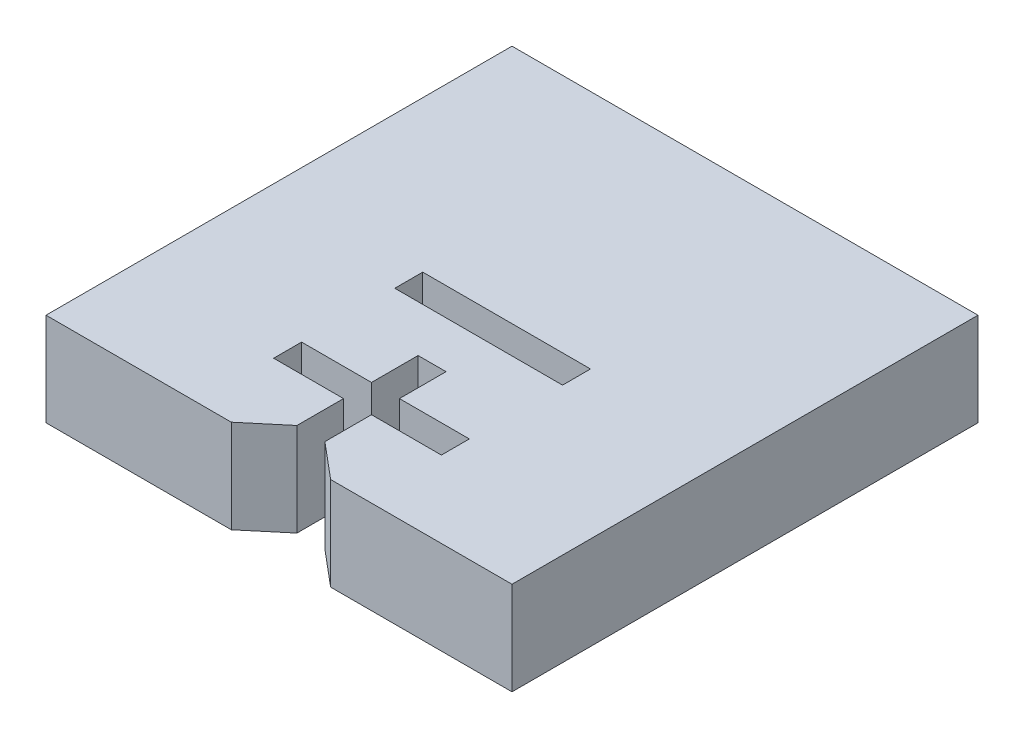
from build123d import *

# Parameters (mm, degrees)
SKETCH1_W           = 18
SKETCH1_H           = 3
BOSS_EXTRUDE1_DEPTH = 10


with BuildPart() as part:
    # Sketch1 → Boss-Extrude1 (new body)
    with BuildSketch(Plane(origin=(0, 0, 0), x_dir=(1, 0, 0), z_dir=(0, 1, 0))):
        Polygon((-30.998896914, 54.583699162), (-11.119378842, 54.583699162), (-7.289156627, 57.797637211), (-7.289156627, 62.797637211), (-14.789156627, 62.797637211), (-14.789156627, 65.797637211), (-7.289156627, 65.797637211), (-7.289156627, 70.797637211), (-4.289156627, 70.797637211), (-4.289156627, 65.797637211), (3.210843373, 65.797637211), (3.210843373, 62.797637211), (-4.289156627, 62.797637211), (-4.289156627, 57.797637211), (-0.458934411, 54.583699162), (19.001103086, 54.583699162), (19.001103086, 104.583699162), (-30.998896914, 104.583699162), align=None)
        with Locations((-5.789156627, 77.297637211)):
            Rectangle(SKETCH1_W, SKETCH1_H, mode=Mode.SUBTRACT)
    extrude(amount=BOSS_EXTRUDE1_DEPTH)


solid = part.part
